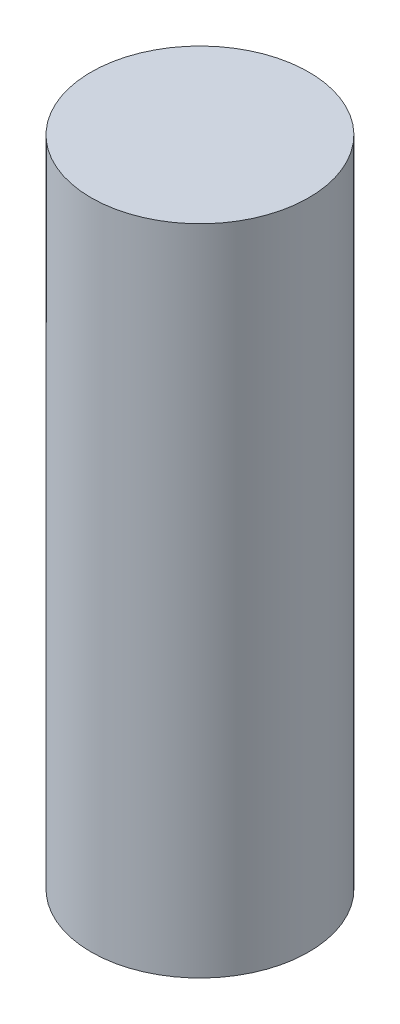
ISO-10303-21;
HEADER;
FILE_DESCRIPTION(('STEP AP214'),'2;1');
FILE_NAME('part.step','',(''),(''),'','','');
FILE_SCHEMA(('AUTOMOTIVE_DESIGN { 1 0 10303 214 1 1 1 1 }'));
ENDSEC;
DATA;
#1=APPLICATION_CONTEXT('core data for automotive mechanical design processes');
#2=APPLICATION_PROTOCOL_DEFINITION('international standard','automotive_design',2000,#1);
#3=PRODUCT_CONTEXT('',#1,'mechanical');
#4=PRODUCT('Part','Part','',(#3));
#5=PRODUCT_RELATED_PRODUCT_CATEGORY('part','',(#4));
#6=PRODUCT_DEFINITION_FORMATION('','',#4);
#7=PRODUCT_DEFINITION_CONTEXT('part definition',#1,'design');
#8=PRODUCT_DEFINITION('design','',#6,#7);
#9=PRODUCT_DEFINITION_SHAPE('','',#8);
#10=(LENGTH_UNIT() NAMED_UNIT(*) SI_UNIT(.MILLI.,.METRE.));
#11=(NAMED_UNIT(*) PLANE_ANGLE_UNIT() SI_UNIT($,.RADIAN.));
#12=(NAMED_UNIT(*) SI_UNIT($,.STERADIAN.) SOLID_ANGLE_UNIT());
#13=UNCERTAINTY_MEASURE_WITH_UNIT(LENGTH_MEASURE(1.E-05),#10,'distance_accuracy_value','');
#14=(GEOMETRIC_REPRESENTATION_CONTEXT(3) GLOBAL_UNCERTAINTY_ASSIGNED_CONTEXT((#13)) GLOBAL_UNIT_ASSIGNED_CONTEXT((#10,
#11,#12)) REPRESENTATION_CONTEXT('',''));
#15=CARTESIAN_POINT('',(0.,0.,0.));
#16=DIRECTION('',(0.,0.,1.));
#17=DIRECTION('',(1.,0.,0.));
#18=AXIS2_PLACEMENT_3D('',#15,#16,#17);
#19=CARTESIAN_POINT('',(-8.88178419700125E-13,9.52500000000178,0.));
#20=DIRECTION('',(0.,-1.,0.));
#21=DIRECTION('',(0.,0.,-1.));
#22=AXIS2_PLACEMENT_3D('',#19,#20,#21);
#23=CYLINDRICAL_SURFACE('',#22,1.5875);
#24=CARTESIAN_POINT('',(-8.88178419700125E-13,9.52500000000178,0.));
#25=DIRECTION('',(0.,1.,0.));
#26=DIRECTION('',(0.,0.,1.));
#27=AXIS2_PLACEMENT_3D('',#24,#25,#26);
#28=CIRCLE('',#27,1.5875);
#29=CARTESIAN_POINT('',(-8.87737799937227E-13,9.52500000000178,1.5875));
#30=VERTEX_POINT('',#29);
#31=EDGE_CURVE('E10',#30,#30,#28,.T.);
#32=ORIENTED_EDGE('',*,*,#31,.F.);
#33=EDGE_LOOP('',(#32));
#34=FACE_BOUND('',#33,.T.);
#35=CARTESIAN_POINT('',(0.,0.,0.));
#36=DIRECTION('',(0.,1.,0.));
#37=DIRECTION('',(0.,0.,1.));
#38=AXIS2_PLACEMENT_3D('',#35,#36,#37);
#39=CIRCLE('',#38,1.5875);
#40=CARTESIAN_POINT('',(0.,0.,1.5875));
#41=VERTEX_POINT('',#40);
#42=EDGE_CURVE('E35',#41,#41,#39,.T.);
#43=ORIENTED_EDGE('',*,*,#42,.T.);
#44=EDGE_LOOP('',(#43));
#45=FACE_BOUND('',#44,.T.);
#46=ADVANCED_FACE('F32',(#34,#45),#23,.T.);
#47=CARTESIAN_POINT('',(-8.88178419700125E-13,9.52500000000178,0.));
#48=DIRECTION('',(0.,1.,0.));
#49=DIRECTION('',(0.,0.,1.));
#50=AXIS2_PLACEMENT_3D('',#47,#48,#49);
#51=PLANE('',#50);
#52=ORIENTED_EDGE('',*,*,#31,.T.);
#53=EDGE_LOOP('',(#52));
#54=FACE_BOUND('',#53,.T.);
#55=ADVANCED_FACE('F47',(#54),#51,.T.);
#56=CARTESIAN_POINT('',(0.,0.,0.));
#57=DIRECTION('',(0.,1.,0.));
#58=DIRECTION('',(0.,0.,1.));
#59=AXIS2_PLACEMENT_3D('',#56,#57,#58);
#60=PLANE('',#59);
#61=ORIENTED_EDGE('',*,*,#42,.F.);
#62=EDGE_LOOP('',(#61));
#63=FACE_BOUND('',#62,.T.);
#64=ADVANCED_FACE('F45',(#63),#60,.F.);
#65=CLOSED_SHELL('',(#46,#55,#64));
#66=MANIFOLD_SOLID_BREP('B2',#65);
#67=ADVANCED_BREP_SHAPE_REPRESENTATION('',(#18,#66),#14);
#68=SHAPE_DEFINITION_REPRESENTATION(#9,#67);
ENDSEC;
END-ISO-10303-21;
